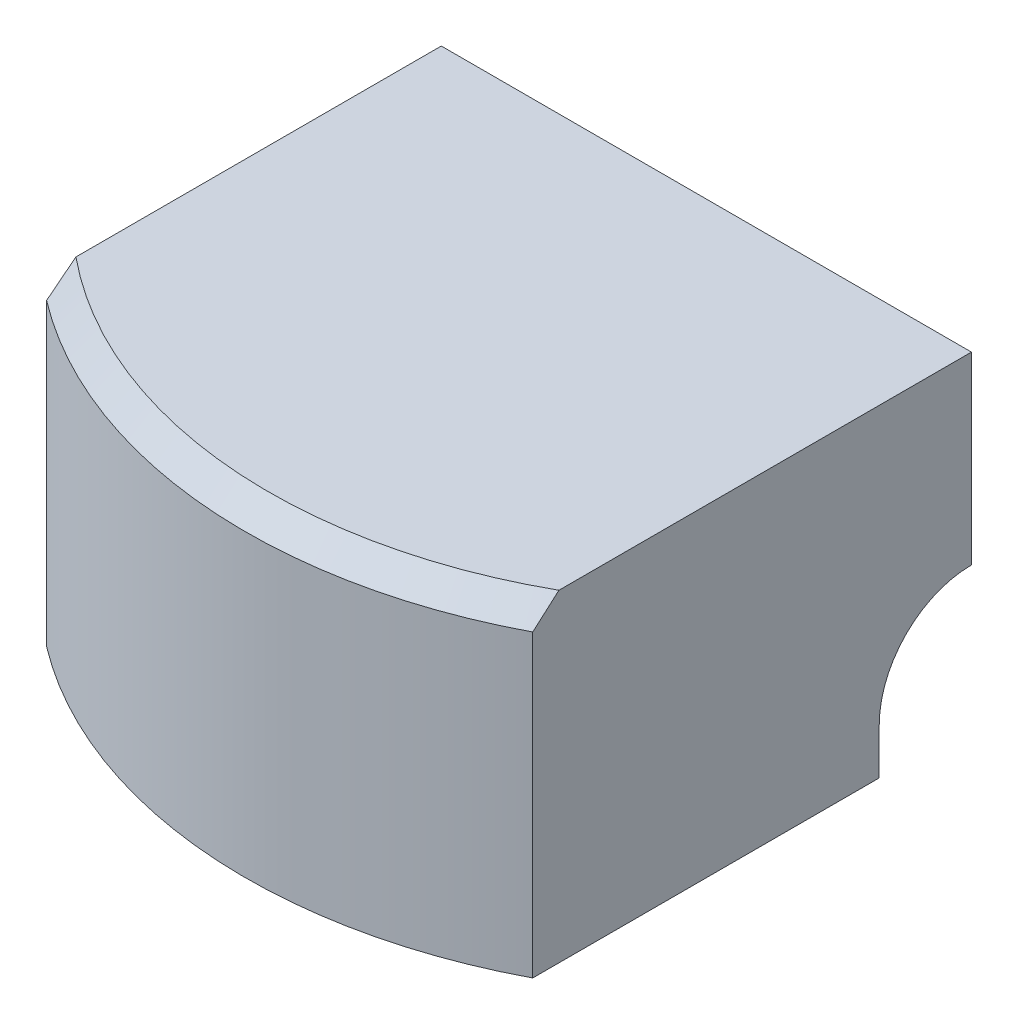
from build123d import *

# Parameters (mm, degrees)
REVOLVE1_ANGLE     = 180
SKETCH2_W          = 73.260717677
SKETCH2_H          = 169.997061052
SKETCH2_W_2        = 72.4630394
CUT_EXTRUDE1_DEPTH = 213.559077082
CUT_EXTRUDE2_START = -63.5
CUT_EXTRUDE2_DEPTH = 63.5


with BuildPart() as part:
    # Sketch1 → Revolve1 (revolve)
    with BuildSketch(Plane.XY):
        with BuildLine():
            Line((-25.4, 0), (-136.525, 0))
            Line((-136.525, 0), (-136.525, 82.55))
            Line((-136.525, 82.55), (-130.175, 88.9))
            Line((-130.175, 88.9), (0, 88.9))
            Line((0, 88.9), (0, 38.1))
            ThreePointArc((0, 38.1), (-17.960512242, 30.660512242), (-25.4, 12.7))
            Line((-25.4, 12.7), (-25.4, 0))
        make_face()
    revolve(axis=Axis((0, 0, 0), (0, 1, 0)), revolution_arc=REVOLVE1_ANGLE)

    # Sketch2 → Cut-Extrude1 (cut, through all)
    with BuildSketch(Plane(origin=(0, 88.9, 0), x_dir=(1, 0, 0), z_dir=(0, 1, 0))):
        with Locations((100.130358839, -84.998530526)):
            Rectangle(SKETCH2_W, SKETCH2_H)
        with Locations((-118.7815197, -84.998530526)):
            Rectangle(SKETCH2_W_2, SKETCH2_H)
    extrude(amount=-CUT_EXTRUDE1_DEPTH, mode=Mode.SUBTRACT)

    # Sketch3 → Cut-Extrude2 (cut)
    with BuildSketch(Plane(origin=(63.5, 0, 0), x_dir=(0, 0, -1), z_dir=(1, 0, 0)).offset(CUT_EXTRUDE2_START)):
        with BuildLine():
            Line((-25.4, 12.7), (-25.4, 0))
            Line((-25.4, 0), (0, 0))
            Line((0, 0), (0, 38.1))
            ThreePointArc((0, 38.1), (-17.960512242, 30.660512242), (-25.4, 12.7))
        make_face()
    extrude(amount=CUT_EXTRUDE2_DEPTH, mode=Mode.SUBTRACT)


solid = part.part
